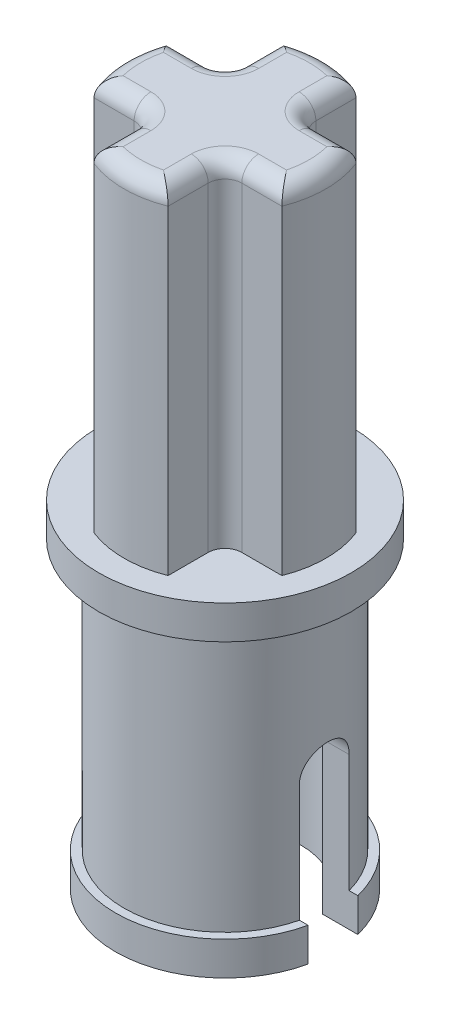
from build123d import *

# Parameters (mm, degrees)
BOSS_EXTRUDE1_DEPTH            = 8
BOSS_EXTRUDE1_DEPTH_BACK       = 8
SKETCH1_R                      = 2.4
BOSS_EXTRUDE2_DEPTH            = 0.8
BOSS_EXTRUDE2_DEPTH_BACK       = 0.8
SKETCH2_R                      = 3
SKETCH4_R                      = 2.6
BOSS_EXTRUDE3_DEPTH            = 0.8
BOSS_EXTRUDE5_START            = -0.8
SKETCH6_R                      = 2.6
BOSS_EXTRUDE5_DEPTH            = 0.8
CUT_EXTRUDE2_REACH             = 18.553
SKETCH7_R                      = 1.8
CUT_EXTRUDE4_REACH             = 11.055
CUT_EXTRUDE4_DIRECTION_2_REACH = 11.055
SKETCH12_R                     = 3
CUT_EXTRUDE7_DEPTH             = 8
SKETCH13_R                     = 3
BOSS_EXTRUDE6_DEPTH            = 0.8
BOSS_EXTRUDE7_START            = 8
BOSS_EXTRUDE7_DEPTH            = 8
FILLET3_R                      = 0.4


with BuildPart() as part:
    # Sketch1 → Boss-Extrude1 (new, two sides: drawn at the far end of the back side and taken through both)
    with BuildSketch(Plane(origin=(0, 0, 0), x_dir=(1, 0, 0), z_dir=(0, 1, 0)).offset(-BOSS_EXTRUDE1_DEPTH_BACK)):
        with Locations(Location((0, 0, 0), (0, 0, 270))):
            Circle(SKETCH1_R)
    extrude(amount=BOSS_EXTRUDE1_DEPTH + BOSS_EXTRUDE1_DEPTH_BACK)

    # Sketch2 → Boss-Extrude2 (add, two sides: drawn at the far end of the back side and taken through both)
    with BuildSketch(Plane(origin=(0, 0, 0), x_dir=(1, 0, 0), z_dir=(0, 1, 0)).offset(-BOSS_EXTRUDE2_DEPTH_BACK)):
        with Locations(Location((0, 0, 0), (0, 0, 270))):
            Circle(SKETCH2_R)
    extrude(amount=BOSS_EXTRUDE2_DEPTH + BOSS_EXTRUDE2_DEPTH_BACK)

    # Sketch4 → Boss-Extrude3 (add)
    with BuildSketch(Plane(origin=(0, 8, 0), x_dir=(1, 0, 0), z_dir=(0, 1, 0))):
        with Locations(Location((0, 0, 0), (0, 0, 270))):
            Circle(SKETCH4_R)
    extrude(amount=-BOSS_EXTRUDE3_DEPTH)

    # Sketch6 → Boss-Extrude5 (add)
    with BuildSketch(Plane.XZ.offset(8).offset(BOSS_EXTRUDE5_START)):
        with Locations(Location((0, 0, 0), (0, 0, 90))):
            Circle(SKETCH6_R)
    extrude(amount=BOSS_EXTRUDE5_DEPTH)

    # Sketch7 → Cut-Extrude2 (cut, up to next)
    with BuildSketch(Plane(origin=(0, 8, 0), x_dir=(1, 0, 0), z_dir=(0, 1, 0)), mode=Mode.PRIVATE) as cut_extrude2_sk1:
        with Locations(Location((0, 0, 0), (0, 0, 270))):
            Circle(SKETCH7_R)
    cut_extrude2_tool1 = extrude(cut_extrude2_sk1.sketch, amount=-CUT_EXTRUDE2_REACH, mode=Mode.PRIVATE) & part.part
    add(cut_extrude2_tool1.solids().sort_by_distance((0, 8, 0))[0], mode=Mode.SUBTRACT)

    # Sketch9 → Cut-Extrude4 (cut, up to next)
    with BuildSketch(Plane(origin=(0, 0, 0), x_dir=(0, 0, -1), z_dir=(1, 0, 0)), mode=Mode.PRIVATE) as cut_extrude4_sk1:
        with BuildLine():
            Line((-0.563999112, 8), (-0.563999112, 4.4))
            ThreePointArc((-0.563999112, 4.4), (0.036000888, 3.8), (0.636000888, 4.4))
            Line((0.636000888, 4.4), (0.636000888, 8))
            Line((0.636000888, 8), (-0.563999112, 8))
        make_face()
    cut_extrude4_tool1 = extrude(cut_extrude4_sk1.sketch, amount=-CUT_EXTRUDE4_REACH, mode=Mode.PRIVATE) & part.part
    # Sketch9 → Cut-Extrude4 (cut, up to next)
    with BuildSketch(Plane(origin=(0, 0, 0), x_dir=(0, 0, -1), z_dir=(1, 0, 0)), mode=Mode.PRIVATE) as cut_extrude4_sk2:
        with BuildLine():
            Line((-0.563999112, -8), (-0.563999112, -4.4))
            ThreePointArc((-0.563999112, -4.4), (0.036000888, -3.8), (0.636000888, -4.4))
            Line((0.636000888, -4.4), (0.636000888, -8))
            Line((0.636000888, -8), (-0.563999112, -8))
        make_face()
    cut_extrude4_tool2 = extrude(cut_extrude4_sk2.sketch, amount=-CUT_EXTRUDE4_REACH, mode=Mode.PRIVATE) & part.part
    add(cut_extrude4_tool1.solids().sort_by_distance((0, 5.962178, -0.036001))[0], mode=Mode.SUBTRACT)
    add(cut_extrude4_tool2.solids().sort_by_distance((0, -5.962178, -0.036001))[0], mode=Mode.SUBTRACT)

    # Sketch9 → Cut-Extrude4 direction 2 (cut, up to next)
    with BuildSketch(Plane(origin=(0, 0, 0), x_dir=(0, 0, -1), z_dir=(1, 0, 0)), mode=Mode.PRIVATE) as cut_extrude4_direction_2_sk1:
        with BuildLine():
            Line((-0.563999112, 8), (-0.563999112, 4.4))
            ThreePointArc((-0.563999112, 4.4), (0.036000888, 3.8), (0.636000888, 4.4))
            Line((0.636000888, 4.4), (0.636000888, 8))
            Line((0.636000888, 8), (-0.563999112, 8))
        make_face()
    cut_extrude4_direction_2_tool1 = extrude(cut_extrude4_direction_2_sk1.sketch, amount=CUT_EXTRUDE4_DIRECTION_2_REACH, mode=Mode.PRIVATE) & part.part
    # Sketch9 → Cut-Extrude4 direction 2 (cut, up to next)
    with BuildSketch(Plane(origin=(0, 0, 0), x_dir=(0, 0, -1), z_dir=(1, 0, 0)), mode=Mode.PRIVATE) as cut_extrude4_direction_2_sk2:
        with BuildLine():
            Line((-0.563999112, -8), (-0.563999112, -4.4))
            ThreePointArc((-0.563999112, -4.4), (0.036000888, -3.8), (0.636000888, -4.4))
            Line((0.636000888, -4.4), (0.636000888, -8))
            Line((0.636000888, -8), (-0.563999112, -8))
        make_face()
    cut_extrude4_direction_2_tool2 = extrude(cut_extrude4_direction_2_sk2.sketch, amount=CUT_EXTRUDE4_DIRECTION_2_REACH, mode=Mode.PRIVATE) & part.part
    add(cut_extrude4_direction_2_tool1.solids().sort_by_distance((0, 5.962178, -0.036001))[0], mode=Mode.SUBTRACT)
    add(cut_extrude4_direction_2_tool2.solids().sort_by_distance((0, -5.962178, -0.036001))[0], mode=Mode.SUBTRACT)

    # Sketch12 → Cut-Extrude7 (cut)
    with BuildSketch(Plane(origin=(0, 0, 0), x_dir=(1, 0, 0), z_dir=(0, 1, 0))):
        with Locations(Location((0, 0, 0), (0, 0, 270))):
            Circle(SKETCH12_R)
    extrude(amount=CUT_EXTRUDE7_DEPTH, mode=Mode.SUBTRACT)

    # Sketch13 → Boss-Extrude6 (add)
    with BuildSketch(Plane(origin=(0, 0, 0), x_dir=(1, 0, 0), z_dir=(0, 1, 0))):
        with Locations(Location((0, 0, 0), (0, 0, 270))):
            Circle(SKETCH13_R)
    extrude(amount=-BOSS_EXTRUDE6_DEPTH)

    # Sketch14 → Boss-Extrude7 (add)
    with BuildSketch(Plane(origin=(0, 0, 0), x_dir=(1, 0, 0), z_dir=(0, 1, 0)).offset(BOSS_EXTRUDE7_START)):
        with BuildLine():
            Line((-0.88, 2.232845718), (-0.88, 1.28))
            ThreePointArc((-0.88, 1.28), (-0.997157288, 0.997157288), (-1.28, 0.88))
            Line((-1.28, 0.88), (-2.232845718, 0.88))
            ThreePointArc((-2.232845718, 0.88), (-2.4, 0), (-2.232845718, -0.88))
            Line((-2.232845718, -0.88), (-1.28, -0.88))
            ThreePointArc((-1.28, -0.88), (-0.997157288, -0.997157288), (-0.88, -1.28))
            Line((-0.88, -1.28), (-0.88, -2.232845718))
            ThreePointArc((-0.88, -2.232845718), (0, -2.4), (0.88, -2.232845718))
            Line((0.88, -2.232845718), (0.88, -1.28))
            ThreePointArc((0.88, -1.28), (0.997157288, -0.997157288), (1.28, -0.88))
            Line((1.28, -0.88), (2.232845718, -0.88))
            ThreePointArc((2.232845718, -0.88), (2.4, 0), (2.232845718, 0.88))
            Line((2.232845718, 0.88), (1.28, 0.88))
            ThreePointArc((1.28, 0.88), (0.997157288, 0.997157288), (0.88, 1.28))
            Line((0.88, 1.28), (0.88, 2.232845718))
            ThreePointArc((0.88, 2.232845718), (0, 2.4), (-0.88, 2.232845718))
        make_face()
    extrude(amount=-BOSS_EXTRUDE7_DEPTH)

    # Fillet3
    fillet3_edges = [part.edges().sort_by_distance(p)[0] for p in [
        (0, 8, 2.4),
        (0.88, 8, 1.756422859),
        (0.997157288, 8, 0.997157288),
        (1.756422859, 8, 0.88),
        (2.4, 8, 0),
        (1.756422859, 8, -0.88),
        (0.997157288, 8, -0.997157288),
        (0.88, 8, -1.756422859),
        (0, 8, -2.4),
        (-0.88, 8, -1.756422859),
        (-0.997157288, 8, -0.997157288),
        (-1.756422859, 8, -0.88),
        (-2.4, 8, 0),
        (-1.756422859, 8, 0.88),
        (-0.997157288, 8, 0.997157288),
        (-0.88, 8, 1.756422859),
    ]]
    fillet(fillet3_edges, radius=FILLET3_R)


solid = part.part
